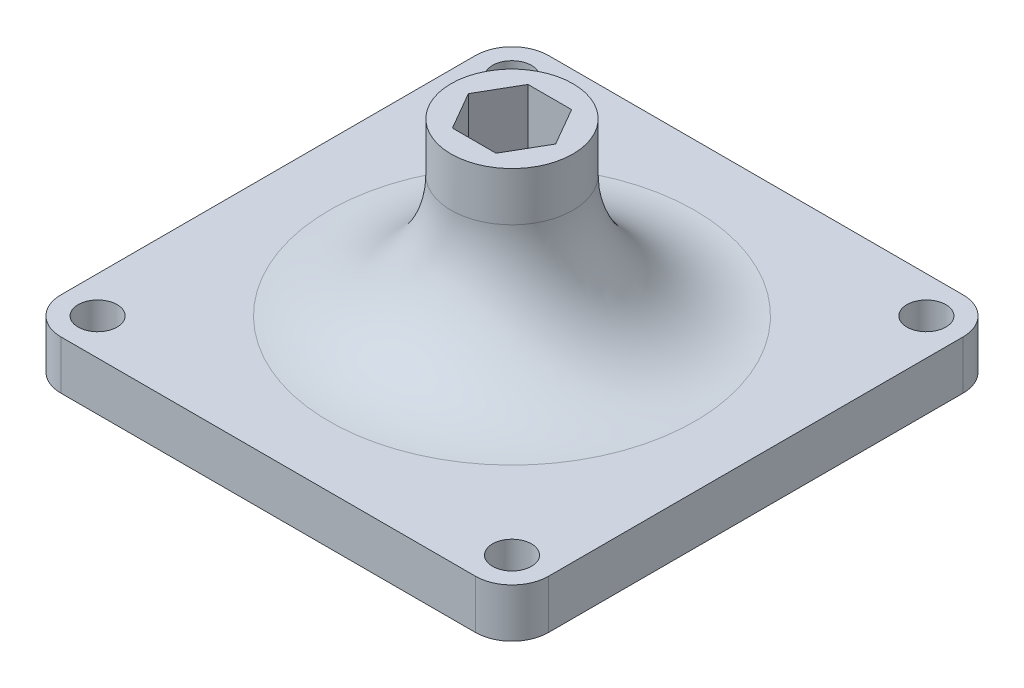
ISO-10303-21;
HEADER;
FILE_DESCRIPTION(('STEP AP214'),'2;1');
FILE_NAME('part.step','',(''),(''),'','','');
FILE_SCHEMA(('AUTOMOTIVE_DESIGN { 1 0 10303 214 1 1 1 1 }'));
ENDSEC;
DATA;
#1=APPLICATION_CONTEXT('core data for automotive mechanical design processes');
#2=APPLICATION_PROTOCOL_DEFINITION('international standard','automotive_design',2000,#1);
#3=PRODUCT_CONTEXT('',#1,'mechanical');
#4=PRODUCT('Part','Part','',(#3));
#5=PRODUCT_RELATED_PRODUCT_CATEGORY('part','',(#4));
#6=PRODUCT_DEFINITION_FORMATION('','',#4);
#7=PRODUCT_DEFINITION_CONTEXT('part definition',#1,'design');
#8=PRODUCT_DEFINITION('design','',#6,#7);
#9=PRODUCT_DEFINITION_SHAPE('','',#8);
#10=(LENGTH_UNIT() NAMED_UNIT(*) SI_UNIT(.MILLI.,.METRE.));
#11=(NAMED_UNIT(*) PLANE_ANGLE_UNIT() SI_UNIT($,.RADIAN.));
#12=(NAMED_UNIT(*) SI_UNIT($,.STERADIAN.) SOLID_ANGLE_UNIT());
#13=UNCERTAINTY_MEASURE_WITH_UNIT(LENGTH_MEASURE(1.E-05),#10,'distance_accuracy_value','');
#14=(GEOMETRIC_REPRESENTATION_CONTEXT(3) GLOBAL_UNCERTAINTY_ASSIGNED_CONTEXT((#13)) GLOBAL_UNIT_ASSIGNED_CONTEXT((#10,
#11,#12)) REPRESENTATION_CONTEXT('',''));
#15=CARTESIAN_POINT('',(0.,0.,0.));
#16=DIRECTION('',(0.,0.,1.));
#17=DIRECTION('',(1.,0.,0.));
#18=AXIS2_PLACEMENT_3D('',#15,#16,#17);
#19=CARTESIAN_POINT('',(17.0000000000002,4.,-17.));
#20=DIRECTION('',(0.,-1.,0.));
#21=DIRECTION('',(0.,0.,-1.));
#22=AXIS2_PLACEMENT_3D('',#19,#20,#21);
#23=PLANE('',#22);
#24=CARTESIAN_POINT('',(0.,4.,0.));
#25=DIRECTION('',(0.,-1.,0.));
#26=DIRECTION('',(0.,0.,-1.));
#27=AXIS2_PLACEMENT_3D('',#24,#25,#26);
#28=CIRCLE('',#27,15.);
#29=CARTESIAN_POINT('',(0.,4.,-15.));
#30=VERTEX_POINT('',#29);
#31=EDGE_CURVE('E11',#30,#30,#28,.T.);
#32=ORIENTED_EDGE('',*,*,#31,.T.);
#33=EDGE_LOOP('',(#32));
#34=FACE_BOUND('',#33,.T.);
#35=CARTESIAN_POINT('',(17.0000000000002,4.,-17.));
#36=DIRECTION('',(0.,1.,0.));
#37=DIRECTION('',(0.,0.,-1.));
#38=AXIS2_PLACEMENT_3D('',#35,#36,#37);
#39=CIRCLE('',#38,3.);
#40=CARTESIAN_POINT('',(20.0000000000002,4.,-17.));
#41=VERTEX_POINT('',#40);
#42=CARTESIAN_POINT('',(17.0000000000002,4.,-20.));
#43=VERTEX_POINT('',#42);
#44=EDGE_CURVE('E168',#41,#43,#39,.T.);
#45=ORIENTED_EDGE('',*,*,#44,.T.);
#46=DIRECTION('',(-1.,0.,0.));
#47=VECTOR('',#46,1.);
#48=CARTESIAN_POINT('',(-16.9999999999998,4.,-20.));
#49=LINE('',#48,#47);
#50=CARTESIAN_POINT('',(-16.9999999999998,4.,-20.));
#51=VERTEX_POINT('',#50);
#52=EDGE_CURVE('E108',#43,#51,#49,.T.);
#53=ORIENTED_EDGE('',*,*,#52,.T.);
#54=CARTESIAN_POINT('',(-16.9999999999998,4.,-17.));
#55=DIRECTION('',(0.,1.,0.));
#56=DIRECTION('',(0.,0.,1.));
#57=AXIS2_PLACEMENT_3D('',#54,#55,#56);
#58=CIRCLE('',#57,3.);
#59=CARTESIAN_POINT('',(-19.9999999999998,4.,-17.));
#60=VERTEX_POINT('',#59);
#61=EDGE_CURVE('E252',#51,#60,#58,.T.);
#62=ORIENTED_EDGE('',*,*,#61,.T.);
#63=DIRECTION('',(0.,0.,1.));
#64=VECTOR('',#63,1.);
#65=CARTESIAN_POINT('',(-19.9999999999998,4.,-17.));
#66=LINE('',#65,#64);
#67=CARTESIAN_POINT('',(-19.9999999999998,4.,17.));
#68=VERTEX_POINT('',#67);
#69=EDGE_CURVE('E254',#60,#68,#66,.T.);
#70=ORIENTED_EDGE('',*,*,#69,.T.);
#71=CARTESIAN_POINT('',(-16.9999999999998,4.,17.));
#72=DIRECTION('',(0.,1.,0.));
#73=DIRECTION('',(0.,0.,1.));
#74=AXIS2_PLACEMENT_3D('',#71,#72,#73);
#75=CIRCLE('',#74,3.);
#76=CARTESIAN_POINT('',(-16.9999999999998,4.,20.));
#77=VERTEX_POINT('',#76);
#78=EDGE_CURVE('E131',#68,#77,#75,.T.);
#79=ORIENTED_EDGE('',*,*,#78,.T.);
#80=DIRECTION('',(1.,0.,0.));
#81=VECTOR('',#80,1.);
#82=CARTESIAN_POINT('',(-16.9999999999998,4.,20.));
#83=LINE('',#82,#81);
#84=CARTESIAN_POINT('',(17.0000000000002,4.,20.));
#85=VERTEX_POINT('',#84);
#86=EDGE_CURVE('E124',#77,#85,#83,.T.);
#87=ORIENTED_EDGE('',*,*,#86,.T.);
#88=CARTESIAN_POINT('',(17.0000000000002,4.,17.));
#89=DIRECTION('',(0.,1.,0.));
#90=DIRECTION('',(0.,0.,1.));
#91=AXIS2_PLACEMENT_3D('',#88,#89,#90);
#92=CIRCLE('',#91,3.);
#93=CARTESIAN_POINT('',(20.0000000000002,4.,17.));
#94=VERTEX_POINT('',#93);
#95=EDGE_CURVE('E128',#85,#94,#92,.T.);
#96=ORIENTED_EDGE('',*,*,#95,.T.);
#97=DIRECTION('',(0.,0.,-1.));
#98=VECTOR('',#97,1.);
#99=CARTESIAN_POINT('',(20.0000000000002,4.,-17.));
#100=LINE('',#99,#98);
#101=EDGE_CURVE('E66',#94,#41,#100,.T.);
#102=ORIENTED_EDGE('',*,*,#101,.T.);
#103=EDGE_LOOP('',(#45,#53,#62,#70,#79,#87,#96,#102));
#104=FACE_BOUND('',#103,.T.);
#105=CARTESIAN_POINT('',(-17.0000000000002,4.,-17.));
#106=DIRECTION('',(0.,1.,0.));
#107=DIRECTION('',(0.,0.,1.));
#108=AXIS2_PLACEMENT_3D('',#105,#106,#107);
#109=CIRCLE('',#108,1.6);
#110=CARTESIAN_POINT('',(-17.0000000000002,4.,-15.4));
#111=VERTEX_POINT('',#110);
#112=EDGE_CURVE('E156',#111,#111,#109,.T.);
#113=ORIENTED_EDGE('',*,*,#112,.F.);
#114=EDGE_LOOP('',(#113));
#115=FACE_BOUND('',#114,.T.);
#116=CARTESIAN_POINT('',(16.9999999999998,4.,-17.));
#117=DIRECTION('',(0.,1.,0.));
#118=DIRECTION('',(0.,0.,1.));
#119=AXIS2_PLACEMENT_3D('',#116,#117,#118);
#120=CIRCLE('',#119,1.60000000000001);
#121=CARTESIAN_POINT('',(16.9999999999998,4.,-15.4));
#122=VERTEX_POINT('',#121);
#123=EDGE_CURVE('E263',#122,#122,#120,.T.);
#124=ORIENTED_EDGE('',*,*,#123,.F.);
#125=EDGE_LOOP('',(#124));
#126=FACE_BOUND('',#125,.T.);
#127=CARTESIAN_POINT('',(17.0000000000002,4.,17.));
#128=DIRECTION('',(0.,1.,0.));
#129=DIRECTION('',(0.,0.,1.));
#130=AXIS2_PLACEMENT_3D('',#127,#128,#129);
#131=CIRCLE('',#130,1.6);
#132=CARTESIAN_POINT('',(17.0000000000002,4.,18.6));
#133=VERTEX_POINT('',#132);
#134=EDGE_CURVE('E269',#133,#133,#131,.T.);
#135=ORIENTED_EDGE('',*,*,#134,.F.);
#136=EDGE_LOOP('',(#135));
#137=FACE_BOUND('',#136,.T.);
#138=CARTESIAN_POINT('',(-16.9999999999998,4.,17.));
#139=DIRECTION('',(0.,1.,0.));
#140=DIRECTION('',(0.,0.,1.));
#141=AXIS2_PLACEMENT_3D('',#138,#139,#140);
#142=CIRCLE('',#141,1.6);
#143=CARTESIAN_POINT('',(-16.9999999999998,4.,18.6));
#144=VERTEX_POINT('',#143);
#145=EDGE_CURVE('E275',#144,#144,#142,.T.);
#146=ORIENTED_EDGE('',*,*,#145,.F.);
#147=EDGE_LOOP('',(#146));
#148=FACE_BOUND('',#147,.T.);
#149=ADVANCED_FACE('F41',(#34,#104,#115,#126,#137,#148),#23,.F.);
#150=CARTESIAN_POINT('',(17.0000000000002,0.,-17.));
#151=DIRECTION('',(0.,-1.,0.));
#152=DIRECTION('',(0.,0.,-1.));
#153=AXIS2_PLACEMENT_3D('',#150,#151,#152);
#154=PLANE('',#153);
#155=CARTESIAN_POINT('',(0.,0.,0.));
#156=DIRECTION('',(0.,-1.,0.));
#157=DIRECTION('',(0.,0.,-1.));
#158=AXIS2_PLACEMENT_3D('',#155,#156,#157);
#159=CIRCLE('',#158,3.75);
#160=CARTESIAN_POINT('',(0.,0.,-3.75));
#161=VERTEX_POINT('',#160);
#162=EDGE_CURVE('E337',#161,#161,#159,.T.);
#163=ORIENTED_EDGE('',*,*,#162,.F.);
#164=EDGE_LOOP('',(#163));
#165=FACE_BOUND('',#164,.T.);
#166=CARTESIAN_POINT('',(17.0000000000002,0.,17.));
#167=DIRECTION('',(0.,1.,0.));
#168=DIRECTION('',(0.,0.,1.));
#169=AXIS2_PLACEMENT_3D('',#166,#167,#168);
#170=CIRCLE('',#169,1.6);
#171=CARTESIAN_POINT('',(17.0000000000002,0.,18.6));
#172=VERTEX_POINT('',#171);
#173=EDGE_CURVE('E272',#172,#172,#170,.T.);
#174=ORIENTED_EDGE('',*,*,#173,.T.);
#175=EDGE_LOOP('',(#174));
#176=FACE_BOUND('',#175,.T.);
#177=CARTESIAN_POINT('',(-17.0000000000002,0.,-17.));
#178=DIRECTION('',(0.,1.,0.));
#179=DIRECTION('',(0.,0.,1.));
#180=AXIS2_PLACEMENT_3D('',#177,#178,#179);
#181=CIRCLE('',#180,1.6);
#182=CARTESIAN_POINT('',(-17.0000000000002,0.,-15.4));
#183=VERTEX_POINT('',#182);
#184=EDGE_CURVE('E260',#183,#183,#181,.T.);
#185=ORIENTED_EDGE('',*,*,#184,.T.);
#186=EDGE_LOOP('',(#185));
#187=FACE_BOUND('',#186,.T.);
#188=CARTESIAN_POINT('',(17.0000000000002,0.,-17.));
#189=DIRECTION('',(0.,1.,0.));
#190=DIRECTION('',(0.,0.,-1.));
#191=AXIS2_PLACEMENT_3D('',#188,#189,#190);
#192=CIRCLE('',#191,3.);
#193=CARTESIAN_POINT('',(20.0000000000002,0.,-17.));
#194=VERTEX_POINT('',#193);
#195=CARTESIAN_POINT('',(17.0000000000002,0.,-20.));
#196=VERTEX_POINT('',#195);
#197=EDGE_CURVE('E152',#194,#196,#192,.T.);
#198=ORIENTED_EDGE('',*,*,#197,.F.);
#199=DIRECTION('',(0.,0.,-1.));
#200=VECTOR('',#199,1.);
#201=CARTESIAN_POINT('',(20.0000000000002,0.,-17.));
#202=LINE('',#201,#200);
#203=CARTESIAN_POINT('',(20.0000000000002,0.,17.));
#204=VERTEX_POINT('',#203);
#205=EDGE_CURVE('E99',#204,#194,#202,.T.);
#206=ORIENTED_EDGE('',*,*,#205,.F.);
#207=CARTESIAN_POINT('',(17.0000000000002,0.,17.));
#208=DIRECTION('',(0.,1.,0.));
#209=DIRECTION('',(0.,0.,1.));
#210=AXIS2_PLACEMENT_3D('',#207,#208,#209);
#211=CIRCLE('',#210,3.);
#212=CARTESIAN_POINT('',(17.0000000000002,0.,20.));
#213=VERTEX_POINT('',#212);
#214=EDGE_CURVE('E165',#213,#204,#211,.T.);
#215=ORIENTED_EDGE('',*,*,#214,.F.);
#216=DIRECTION('',(1.,0.,0.));
#217=VECTOR('',#216,1.);
#218=CARTESIAN_POINT('',(-16.9999999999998,0.,20.));
#219=LINE('',#218,#217);
#220=CARTESIAN_POINT('',(-16.9999999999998,0.,20.));
#221=VERTEX_POINT('',#220);
#222=EDGE_CURVE('E140',#221,#213,#219,.T.);
#223=ORIENTED_EDGE('',*,*,#222,.F.);
#224=CARTESIAN_POINT('',(-16.9999999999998,0.,17.));
#225=DIRECTION('',(0.,1.,0.));
#226=DIRECTION('',(0.,0.,1.));
#227=AXIS2_PLACEMENT_3D('',#224,#225,#226);
#228=CIRCLE('',#227,3.);
#229=CARTESIAN_POINT('',(-19.9999999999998,0.,17.));
#230=VERTEX_POINT('',#229);
#231=EDGE_CURVE('E162',#230,#221,#228,.T.);
#232=ORIENTED_EDGE('',*,*,#231,.F.);
#233=DIRECTION('',(0.,0.,1.));
#234=VECTOR('',#233,1.);
#235=CARTESIAN_POINT('',(-19.9999999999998,0.,-17.));
#236=LINE('',#235,#234);
#237=CARTESIAN_POINT('',(-19.9999999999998,0.,-17.));
#238=VERTEX_POINT('',#237);
#239=EDGE_CURVE('E160',#238,#230,#236,.T.);
#240=ORIENTED_EDGE('',*,*,#239,.F.);
#241=CARTESIAN_POINT('',(-16.9999999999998,0.,-17.));
#242=DIRECTION('',(0.,1.,0.));
#243=DIRECTION('',(0.,0.,1.));
#244=AXIS2_PLACEMENT_3D('',#241,#242,#243);
#245=CIRCLE('',#244,3.);
#246=CARTESIAN_POINT('',(-16.9999999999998,0.,-20.));
#247=VERTEX_POINT('',#246);
#248=EDGE_CURVE('E158',#247,#238,#245,.T.);
#249=ORIENTED_EDGE('',*,*,#248,.F.);
#250=DIRECTION('',(-1.,0.,0.));
#251=VECTOR('',#250,1.);
#252=CARTESIAN_POINT('',(-16.9999999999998,0.,-20.));
#253=LINE('',#252,#251);
#254=EDGE_CURVE('E155',#196,#247,#253,.T.);
#255=ORIENTED_EDGE('',*,*,#254,.F.);
#256=EDGE_LOOP('',(#198,#206,#215,#223,#232,#240,#249,#255));
#257=FACE_BOUND('',#256,.T.);
#258=CARTESIAN_POINT('',(16.9999999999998,0.,-17.));
#259=DIRECTION('',(0.,1.,0.));
#260=DIRECTION('',(0.,0.,1.));
#261=AXIS2_PLACEMENT_3D('',#258,#259,#260);
#262=CIRCLE('',#261,1.60000000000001);
#263=CARTESIAN_POINT('',(16.9999999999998,0.,-15.4));
#264=VERTEX_POINT('',#263);
#265=EDGE_CURVE('E266',#264,#264,#262,.T.);
#266=ORIENTED_EDGE('',*,*,#265,.T.);
#267=EDGE_LOOP('',(#266));
#268=FACE_BOUND('',#267,.T.);
#269=CARTESIAN_POINT('',(-16.9999999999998,0.,17.));
#270=DIRECTION('',(0.,1.,0.));
#271=DIRECTION('',(0.,0.,1.));
#272=AXIS2_PLACEMENT_3D('',#269,#270,#271);
#273=CIRCLE('',#272,1.6);
#274=CARTESIAN_POINT('',(-16.9999999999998,0.,18.6));
#275=VERTEX_POINT('',#274);
#276=EDGE_CURVE('E278',#275,#275,#273,.T.);
#277=ORIENTED_EDGE('',*,*,#276,.T.);
#278=EDGE_LOOP('',(#277));
#279=FACE_BOUND('',#278,.T.);
#280=ADVANCED_FACE('F204',(#165,#176,#187,#257,#268,#279),#154,.T.);
#281=CARTESIAN_POINT('',(17.0000000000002,4.,-17.));
#282=DIRECTION('',(0.,-1.,0.));
#283=DIRECTION('',(0.,0.,-1.));
#284=AXIS2_PLACEMENT_3D('',#281,#282,#283);
#285=CYLINDRICAL_SURFACE('',#284,3.);
#286=ORIENTED_EDGE('',*,*,#197,.T.);
#287=DIRECTION('',(0.,-1.,0.));
#288=VECTOR('',#287,1.);
#289=CARTESIAN_POINT('',(17.0000000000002,4.,-20.));
#290=LINE('',#289,#288);
#291=EDGE_CURVE('E181',#43,#196,#290,.T.);
#292=ORIENTED_EDGE('',*,*,#291,.F.);
#293=ORIENTED_EDGE('',*,*,#44,.F.);
#294=DIRECTION('',(0.,-1.,0.));
#295=VECTOR('',#294,1.);
#296=CARTESIAN_POINT('',(20.0000000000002,4.,-17.));
#297=LINE('',#296,#295);
#298=EDGE_CURVE('E148',#41,#194,#297,.T.);
#299=ORIENTED_EDGE('',*,*,#298,.T.);
#300=EDGE_LOOP('',(#286,#292,#293,#299));
#301=FACE_BOUND('',#300,.T.);
#302=ADVANCED_FACE('F211',(#301),#285,.T.);
#303=CARTESIAN_POINT('',(-16.9999999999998,4.,-20.));
#304=DIRECTION('',(0.,0.,1.));
#305=DIRECTION('',(1.,0.,0.));
#306=AXIS2_PLACEMENT_3D('',#303,#304,#305);
#307=PLANE('',#306);
#308=ORIENTED_EDGE('',*,*,#254,.T.);
#309=DIRECTION('',(0.,-1.,0.));
#310=VECTOR('',#309,1.);
#311=CARTESIAN_POINT('',(-16.9999999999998,4.,-20.));
#312=LINE('',#311,#310);
#313=EDGE_CURVE('E178',#51,#247,#312,.T.);
#314=ORIENTED_EDGE('',*,*,#313,.F.);
#315=ORIENTED_EDGE('',*,*,#52,.F.);
#316=ORIENTED_EDGE('',*,*,#291,.T.);
#317=EDGE_LOOP('',(#308,#314,#315,#316));
#318=FACE_BOUND('',#317,.T.);
#319=ADVANCED_FACE('F236',(#318),#307,.F.);
#320=CARTESIAN_POINT('',(-16.9999999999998,4.,-17.));
#321=DIRECTION('',(0.,-1.,0.));
#322=DIRECTION('',(0.,0.,-1.));
#323=AXIS2_PLACEMENT_3D('',#320,#321,#322);
#324=CYLINDRICAL_SURFACE('',#323,3.);
#325=ORIENTED_EDGE('',*,*,#248,.T.);
#326=DIRECTION('',(0.,-1.,0.));
#327=VECTOR('',#326,1.);
#328=CARTESIAN_POINT('',(-19.9999999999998,4.,-17.));
#329=LINE('',#328,#327);
#330=EDGE_CURVE('E175',#60,#238,#329,.T.);
#331=ORIENTED_EDGE('',*,*,#330,.F.);
#332=ORIENTED_EDGE('',*,*,#61,.F.);
#333=ORIENTED_EDGE('',*,*,#313,.T.);
#334=EDGE_LOOP('',(#325,#331,#332,#333));
#335=FACE_BOUND('',#334,.T.);
#336=ADVANCED_FACE('F232',(#335),#324,.T.);
#337=CARTESIAN_POINT('',(-19.9999999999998,4.,-17.));
#338=DIRECTION('',(1.,0.,0.));
#339=DIRECTION('',(0.,0.,-1.));
#340=AXIS2_PLACEMENT_3D('',#337,#338,#339);
#341=PLANE('',#340);
#342=ORIENTED_EDGE('',*,*,#239,.T.);
#343=DIRECTION('',(0.,-1.,0.));
#344=VECTOR('',#343,1.);
#345=CARTESIAN_POINT('',(-19.9999999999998,4.,17.));
#346=LINE('',#345,#344);
#347=EDGE_CURVE('E172',#68,#230,#346,.T.);
#348=ORIENTED_EDGE('',*,*,#347,.F.);
#349=ORIENTED_EDGE('',*,*,#69,.F.);
#350=ORIENTED_EDGE('',*,*,#330,.T.);
#351=EDGE_LOOP('',(#342,#348,#349,#350));
#352=FACE_BOUND('',#351,.T.);
#353=ADVANCED_FACE('F228',(#352),#341,.F.);
#354=CARTESIAN_POINT('',(-16.9999999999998,4.,17.));
#355=DIRECTION('',(0.,-1.,0.));
#356=DIRECTION('',(0.,0.,-1.));
#357=AXIS2_PLACEMENT_3D('',#354,#355,#356);
#358=CYLINDRICAL_SURFACE('',#357,3.);
#359=ORIENTED_EDGE('',*,*,#231,.T.);
#360=DIRECTION('',(0.,-1.,0.));
#361=VECTOR('',#360,1.);
#362=CARTESIAN_POINT('',(-16.9999999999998,4.,20.));
#363=LINE('',#362,#361);
#364=EDGE_CURVE('E143',#77,#221,#363,.T.);
#365=ORIENTED_EDGE('',*,*,#364,.F.);
#366=ORIENTED_EDGE('',*,*,#78,.F.);
#367=ORIENTED_EDGE('',*,*,#347,.T.);
#368=EDGE_LOOP('',(#359,#365,#366,#367));
#369=FACE_BOUND('',#368,.T.);
#370=ADVANCED_FACE('F225',(#369),#358,.T.);
#371=CARTESIAN_POINT('',(-16.9999999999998,4.,20.));
#372=DIRECTION('',(0.,0.,-1.));
#373=DIRECTION('',(-1.,0.,0.));
#374=AXIS2_PLACEMENT_3D('',#371,#372,#373);
#375=PLANE('',#374);
#376=ORIENTED_EDGE('',*,*,#222,.T.);
#377=DIRECTION('',(0.,-1.,0.));
#378=VECTOR('',#377,1.);
#379=CARTESIAN_POINT('',(17.0000000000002,4.,20.));
#380=LINE('',#379,#378);
#381=EDGE_CURVE('E137',#85,#213,#380,.T.);
#382=ORIENTED_EDGE('',*,*,#381,.F.);
#383=ORIENTED_EDGE('',*,*,#86,.F.);
#384=ORIENTED_EDGE('',*,*,#364,.T.);
#385=EDGE_LOOP('',(#376,#382,#383,#384));
#386=FACE_BOUND('',#385,.T.);
#387=ADVANCED_FACE('F138',(#386),#375,.F.);
#388=CARTESIAN_POINT('',(17.0000000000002,4.,17.));
#389=DIRECTION('',(0.,-1.,0.));
#390=DIRECTION('',(0.,0.,-1.));
#391=AXIS2_PLACEMENT_3D('',#388,#389,#390);
#392=CYLINDRICAL_SURFACE('',#391,3.);
#393=ORIENTED_EDGE('',*,*,#214,.T.);
#394=DIRECTION('',(0.,-1.,0.));
#395=VECTOR('',#394,1.);
#396=CARTESIAN_POINT('',(20.0000000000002,4.,17.));
#397=LINE('',#396,#395);
#398=EDGE_CURVE('E144',#94,#204,#397,.T.);
#399=ORIENTED_EDGE('',*,*,#398,.F.);
#400=ORIENTED_EDGE('',*,*,#95,.F.);
#401=ORIENTED_EDGE('',*,*,#381,.T.);
#402=EDGE_LOOP('',(#393,#399,#400,#401));
#403=FACE_BOUND('',#402,.T.);
#404=ADVANCED_FACE('F146',(#403),#392,.T.);
#405=CARTESIAN_POINT('',(20.0000000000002,4.,-17.));
#406=DIRECTION('',(-1.,0.,0.));
#407=DIRECTION('',(0.,0.,1.));
#408=AXIS2_PLACEMENT_3D('',#405,#406,#407);
#409=PLANE('',#408);
#410=ORIENTED_EDGE('',*,*,#205,.T.);
#411=ORIENTED_EDGE('',*,*,#298,.F.);
#412=ORIENTED_EDGE('',*,*,#101,.F.);
#413=ORIENTED_EDGE('',*,*,#398,.T.);
#414=EDGE_LOOP('',(#410,#411,#412,#413));
#415=FACE_BOUND('',#414,.T.);
#416=ADVANCED_FACE('F218',(#415),#409,.F.);
#417=CARTESIAN_POINT('',(-17.0000000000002,4.,-17.));
#418=DIRECTION('',(0.,-1.,0.));
#419=DIRECTION('',(0.,0.,-1.));
#420=AXIS2_PLACEMENT_3D('',#417,#418,#419);
#421=CYLINDRICAL_SURFACE('',#420,1.6);
#422=ORIENTED_EDGE('',*,*,#112,.T.);
#423=EDGE_LOOP('',(#422));
#424=FACE_BOUND('',#423,.T.);
#425=ORIENTED_EDGE('',*,*,#184,.F.);
#426=EDGE_LOOP('',(#425));
#427=FACE_BOUND('',#426,.T.);
#428=ADVANCED_FACE('F215',(#424,#427),#421,.F.);
#429=CARTESIAN_POINT('',(16.9999999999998,4.,-17.));
#430=DIRECTION('',(0.,-1.,0.));
#431=DIRECTION('',(0.,0.,-1.));
#432=AXIS2_PLACEMENT_3D('',#429,#430,#431);
#433=CYLINDRICAL_SURFACE('',#432,1.60000000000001);
#434=ORIENTED_EDGE('',*,*,#123,.T.);
#435=EDGE_LOOP('',(#434));
#436=FACE_BOUND('',#435,.T.);
#437=ORIENTED_EDGE('',*,*,#265,.F.);
#438=EDGE_LOOP('',(#437));
#439=FACE_BOUND('',#438,.T.);
#440=ADVANCED_FACE('F418',(#436,#439),#433,.F.);
#441=CARTESIAN_POINT('',(17.0000000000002,4.,17.));
#442=DIRECTION('',(0.,-1.,0.));
#443=DIRECTION('',(0.,0.,-1.));
#444=AXIS2_PLACEMENT_3D('',#441,#442,#443);
#445=CYLINDRICAL_SURFACE('',#444,1.6);
#446=ORIENTED_EDGE('',*,*,#134,.T.);
#447=EDGE_LOOP('',(#446));
#448=FACE_BOUND('',#447,.T.);
#449=ORIENTED_EDGE('',*,*,#173,.F.);
#450=EDGE_LOOP('',(#449));
#451=FACE_BOUND('',#450,.T.);
#452=ADVANCED_FACE('F415',(#448,#451),#445,.F.);
#453=CARTESIAN_POINT('',(-16.9999999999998,4.,17.));
#454=DIRECTION('',(0.,-1.,0.));
#455=DIRECTION('',(0.,0.,-1.));
#456=AXIS2_PLACEMENT_3D('',#453,#454,#455);
#457=CYLINDRICAL_SURFACE('',#456,1.6);
#458=ORIENTED_EDGE('',*,*,#145,.T.);
#459=EDGE_LOOP('',(#458));
#460=FACE_BOUND('',#459,.T.);
#461=ORIENTED_EDGE('',*,*,#276,.F.);
#462=EDGE_LOOP('',(#461));
#463=FACE_BOUND('',#462,.T.);
#464=ADVANCED_FACE('F413',(#460,#463),#457,.F.);
#465=CARTESIAN_POINT('',(0.,18.,0.));
#466=DIRECTION('',(0.,-1.,0.));
#467=DIRECTION('',(0.,0.,-1.));
#468=AXIS2_PLACEMENT_3D('',#465,#466,#467);
#469=CYLINDRICAL_SURFACE('',#468,5.);
#470=CARTESIAN_POINT('',(0.,14.,0.));
#471=DIRECTION('',(0.,-1.,0.));
#472=DIRECTION('',(0.,0.,-1.));
#473=AXIS2_PLACEMENT_3D('',#470,#471,#472);
#474=CIRCLE('',#473,5.);
#475=CARTESIAN_POINT('',(0.,14.,-5.));
#476=VERTEX_POINT('',#475);
#477=EDGE_CURVE('E50',#476,#476,#474,.F.);
#478=ORIENTED_EDGE('',*,*,#477,.T.);
#479=EDGE_LOOP('',(#478));
#480=FACE_BOUND('',#479,.T.);
#481=CARTESIAN_POINT('',(0.,18.,0.));
#482=DIRECTION('',(0.,1.,0.));
#483=DIRECTION('',(0.,0.,1.));
#484=AXIS2_PLACEMENT_3D('',#481,#482,#483);
#485=CIRCLE('',#484,5.);
#486=CARTESIAN_POINT('',(0.,18.,5.));
#487=VERTEX_POINT('',#486);
#488=EDGE_CURVE('E281',#487,#487,#485,.T.);
#489=ORIENTED_EDGE('',*,*,#488,.F.);
#490=EDGE_LOOP('',(#489));
#491=FACE_BOUND('',#490,.T.);
#492=ADVANCED_FACE('F186',(#480,#491),#469,.T.);
#493=CARTESIAN_POINT('',(0.,18.,0.));
#494=DIRECTION('',(0.,1.,0.));
#495=DIRECTION('',(0.,0.,1.));
#496=AXIS2_PLACEMENT_3D('',#493,#494,#495);
#497=PLANE('',#496);
#498=DIRECTION('',(0.5,0.,-0.866025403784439));
#499=VECTOR('',#498,1.);
#500=CARTESIAN_POINT('',(1.78978583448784,18.,3.1));
#501=LINE('',#500,#499);
#502=CARTESIAN_POINT('',(1.78978583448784,18.,3.1));
#503=VERTEX_POINT('',#502);
#504=CARTESIAN_POINT('',(3.57957166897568,18.,0.));
#505=VERTEX_POINT('',#504);
#506=EDGE_CURVE('E57',#503,#505,#501,.T.);
#507=ORIENTED_EDGE('',*,*,#506,.F.);
#508=DIRECTION('',(1.,0.,0.));
#509=VECTOR('',#508,1.);
#510=CARTESIAN_POINT('',(-1.78978583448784,18.,3.1));
#511=LINE('',#510,#509);
#512=CARTESIAN_POINT('',(-1.78978583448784,18.,3.1));
#513=VERTEX_POINT('',#512);
#514=EDGE_CURVE('E303',#513,#503,#511,.T.);
#515=ORIENTED_EDGE('',*,*,#514,.F.);
#516=DIRECTION('',(0.5,0.,0.866025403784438));
#517=VECTOR('',#516,1.);
#518=CARTESIAN_POINT('',(-3.57957166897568,18.,0.));
#519=LINE('',#518,#517);
#520=CARTESIAN_POINT('',(-3.57957166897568,18.,0.));
#521=VERTEX_POINT('',#520);
#522=EDGE_CURVE('E307',#521,#513,#519,.T.);
#523=ORIENTED_EDGE('',*,*,#522,.F.);
#524=DIRECTION('',(-0.5,0.,0.866025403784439));
#525=VECTOR('',#524,1.);
#526=CARTESIAN_POINT('',(-1.78978583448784,18.,-3.1));
#527=LINE('',#526,#525);
#528=CARTESIAN_POINT('',(-1.78978583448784,18.,-3.1));
#529=VERTEX_POINT('',#528);
#530=EDGE_CURVE('E310',#529,#521,#527,.T.);
#531=ORIENTED_EDGE('',*,*,#530,.F.);
#532=DIRECTION('',(-1.,0.,0.));
#533=VECTOR('',#532,1.);
#534=CARTESIAN_POINT('',(1.78978583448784,18.,-3.1));
#535=LINE('',#534,#533);
#536=CARTESIAN_POINT('',(1.78978583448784,18.,-3.1));
#537=VERTEX_POINT('',#536);
#538=EDGE_CURVE('E313',#537,#529,#535,.T.);
#539=ORIENTED_EDGE('',*,*,#538,.F.);
#540=DIRECTION('',(-0.5,0.,-0.866025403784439));
#541=VECTOR('',#540,1.);
#542=CARTESIAN_POINT('',(3.57957166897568,18.,0.));
#543=LINE('',#542,#541);
#544=EDGE_CURVE('E316',#505,#537,#543,.T.);
#545=ORIENTED_EDGE('',*,*,#544,.F.);
#546=EDGE_LOOP('',(#507,#515,#523,#531,#539,#545));
#547=FACE_BOUND('',#546,.T.);
#548=ORIENTED_EDGE('',*,*,#488,.T.);
#549=EDGE_LOOP('',(#548));
#550=FACE_BOUND('',#549,.T.);
#551=ADVANCED_FACE('F191',(#547,#550),#497,.T.);
#552=CARTESIAN_POINT('',(0.,14.,0.));
#553=DIRECTION('',(0.,-1.,0.));
#554=DIRECTION('',(0.,0.,-1.));
#555=AXIS2_PLACEMENT_3D('',#552,#553,#554);
#556=TOROIDAL_SURFACE('',#555,15.,10.);
#557=ORIENTED_EDGE('',*,*,#31,.F.);
#558=EDGE_LOOP('',(#557));
#559=FACE_BOUND('',#558,.T.);
#560=ORIENTED_EDGE('',*,*,#477,.F.);
#561=EDGE_LOOP('',(#560));
#562=FACE_BOUND('',#561,.T.);
#563=ADVANCED_FACE('F43',(#559,#562),#556,.F.);
#564=CARTESIAN_POINT('',(1.78978583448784,10.,3.1));
#565=DIRECTION('',(0.866025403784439,0.,0.5));
#566=DIRECTION('',(0.5,0.,-0.866025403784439));
#567=AXIS2_PLACEMENT_3D('',#564,#565,#566);
#568=PLANE('',#567);
#569=ORIENTED_EDGE('',*,*,#506,.T.);
#570=DIRECTION('',(0.,1.,0.));
#571=VECTOR('',#570,1.);
#572=CARTESIAN_POINT('',(3.57957166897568,10.,0.));
#573=LINE('',#572,#571);
#574=CARTESIAN_POINT('',(3.57957166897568,10.,0.));
#575=VERTEX_POINT('',#574);
#576=EDGE_CURVE('E287',#575,#505,#573,.T.);
#577=ORIENTED_EDGE('',*,*,#576,.F.);
#578=DIRECTION('',(0.5,0.,-0.866025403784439));
#579=VECTOR('',#578,1.);
#580=CARTESIAN_POINT('',(1.78978583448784,10.,3.1));
#581=LINE('',#580,#579);
#582=CARTESIAN_POINT('',(1.78978583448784,10.,3.1));
#583=VERTEX_POINT('',#582);
#584=EDGE_CURVE('E306',#583,#575,#581,.T.);
#585=ORIENTED_EDGE('',*,*,#584,.F.);
#586=DIRECTION('',(0.,1.,0.));
#587=VECTOR('',#586,1.);
#588=CARTESIAN_POINT('',(1.78978583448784,10.,3.1));
#589=LINE('',#588,#587);
#590=EDGE_CURVE('E286',#583,#503,#589,.T.);
#591=ORIENTED_EDGE('',*,*,#590,.T.);
#592=EDGE_LOOP('',(#569,#577,#585,#591));
#593=FACE_BOUND('',#592,.T.);
#594=ADVANCED_FACE('F190',(#593),#568,.F.);
#595=CARTESIAN_POINT('',(-1.78978583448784,10.,3.1));
#596=DIRECTION('',(0.,0.,1.));
#597=DIRECTION('',(1.,0.,0.));
#598=AXIS2_PLACEMENT_3D('',#595,#596,#597);
#599=PLANE('',#598);
#600=ORIENTED_EDGE('',*,*,#514,.T.);
#601=ORIENTED_EDGE('',*,*,#590,.F.);
#602=DIRECTION('',(1.,0.,0.));
#603=VECTOR('',#602,1.);
#604=CARTESIAN_POINT('',(-1.78978583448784,10.,3.1));
#605=LINE('',#604,#603);
#606=CARTESIAN_POINT('',(-1.78978583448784,10.,3.1));
#607=VERTEX_POINT('',#606);
#608=EDGE_CURVE('E290',#607,#583,#605,.T.);
#609=ORIENTED_EDGE('',*,*,#608,.F.);
#610=DIRECTION('',(0.,1.,0.));
#611=VECTOR('',#610,1.);
#612=CARTESIAN_POINT('',(-1.78978583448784,10.,3.1));
#613=LINE('',#612,#611);
#614=EDGE_CURVE('E299',#607,#513,#613,.T.);
#615=ORIENTED_EDGE('',*,*,#614,.T.);
#616=EDGE_LOOP('',(#600,#601,#609,#615));
#617=FACE_BOUND('',#616,.T.);
#618=ADVANCED_FACE('F198',(#617),#599,.F.);
#619=CARTESIAN_POINT('',(-3.57957166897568,10.,0.));
#620=DIRECTION('',(-0.866025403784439,0.,0.5));
#621=DIRECTION('',(0.5,0.,0.866025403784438));
#622=AXIS2_PLACEMENT_3D('',#619,#620,#621);
#623=PLANE('',#622);
#624=ORIENTED_EDGE('',*,*,#522,.T.);
#625=ORIENTED_EDGE('',*,*,#614,.F.);
#626=DIRECTION('',(0.5,0.,0.866025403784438));
#627=VECTOR('',#626,1.);
#628=CARTESIAN_POINT('',(-3.57957166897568,10.,0.));
#629=LINE('',#628,#627);
#630=CARTESIAN_POINT('',(-3.57957166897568,10.,0.));
#631=VERTEX_POINT('',#630);
#632=EDGE_CURVE('E323',#631,#607,#629,.T.);
#633=ORIENTED_EDGE('',*,*,#632,.F.);
#634=DIRECTION('',(0.,1.,0.));
#635=VECTOR('',#634,1.);
#636=CARTESIAN_POINT('',(-3.57957166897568,10.,0.));
#637=LINE('',#636,#635);
#638=EDGE_CURVE('E296',#631,#521,#637,.T.);
#639=ORIENTED_EDGE('',*,*,#638,.T.);
#640=EDGE_LOOP('',(#624,#625,#633,#639));
#641=FACE_BOUND('',#640,.T.);
#642=ADVANCED_FACE('F382',(#641),#623,.F.);
#643=CARTESIAN_POINT('',(-1.78978583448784,10.,-3.1));
#644=DIRECTION('',(-0.866025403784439,0.,-0.5));
#645=DIRECTION('',(-0.5,0.,0.866025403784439));
#646=AXIS2_PLACEMENT_3D('',#643,#644,#645);
#647=PLANE('',#646);
#648=ORIENTED_EDGE('',*,*,#530,.T.);
#649=ORIENTED_EDGE('',*,*,#638,.F.);
#650=DIRECTION('',(-0.5,0.,0.866025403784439));
#651=VECTOR('',#650,1.);
#652=CARTESIAN_POINT('',(-1.78978583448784,10.,-3.1));
#653=LINE('',#652,#651);
#654=CARTESIAN_POINT('',(-1.78978583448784,10.,-3.1));
#655=VERTEX_POINT('',#654);
#656=EDGE_CURVE('E326',#655,#631,#653,.T.);
#657=ORIENTED_EDGE('',*,*,#656,.F.);
#658=DIRECTION('',(0.,1.,0.));
#659=VECTOR('',#658,1.);
#660=CARTESIAN_POINT('',(-1.78978583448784,10.,-3.1));
#661=LINE('',#660,#659);
#662=EDGE_CURVE('E293',#655,#529,#661,.T.);
#663=ORIENTED_EDGE('',*,*,#662,.T.);
#664=EDGE_LOOP('',(#648,#649,#657,#663));
#665=FACE_BOUND('',#664,.T.);
#666=ADVANCED_FACE('F399',(#665),#647,.F.);
#667=CARTESIAN_POINT('',(1.78978583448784,10.,-3.1));
#668=DIRECTION('',(0.,0.,-1.));
#669=DIRECTION('',(-1.,0.,0.));
#670=AXIS2_PLACEMENT_3D('',#667,#668,#669);
#671=PLANE('',#670);
#672=ORIENTED_EDGE('',*,*,#538,.T.);
#673=ORIENTED_EDGE('',*,*,#662,.F.);
#674=DIRECTION('',(-1.,0.,0.));
#675=VECTOR('',#674,1.);
#676=CARTESIAN_POINT('',(1.78978583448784,10.,-3.1));
#677=LINE('',#676,#675);
#678=CARTESIAN_POINT('',(1.78978583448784,10.,-3.1));
#679=VERTEX_POINT('',#678);
#680=EDGE_CURVE('E329',#679,#655,#677,.T.);
#681=ORIENTED_EDGE('',*,*,#680,.F.);
#682=DIRECTION('',(0.,1.,0.));
#683=VECTOR('',#682,1.);
#684=CARTESIAN_POINT('',(1.78978583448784,10.,-3.1));
#685=LINE('',#684,#683);
#686=EDGE_CURVE('E289',#679,#537,#685,.T.);
#687=ORIENTED_EDGE('',*,*,#686,.T.);
#688=EDGE_LOOP('',(#672,#673,#681,#687));
#689=FACE_BOUND('',#688,.T.);
#690=ADVANCED_FACE('F395',(#689),#671,.F.);
#691=CARTESIAN_POINT('',(3.57957166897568,10.,0.));
#692=DIRECTION('',(0.866025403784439,0.,-0.5));
#693=DIRECTION('',(-0.5,0.,-0.866025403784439));
#694=AXIS2_PLACEMENT_3D('',#691,#692,#693);
#695=PLANE('',#694);
#696=ORIENTED_EDGE('',*,*,#544,.T.);
#697=ORIENTED_EDGE('',*,*,#686,.F.);
#698=DIRECTION('',(-0.5,0.,-0.866025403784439));
#699=VECTOR('',#698,1.);
#700=CARTESIAN_POINT('',(3.57957166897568,10.,0.));
#701=LINE('',#700,#699);
#702=EDGE_CURVE('E332',#575,#679,#701,.T.);
#703=ORIENTED_EDGE('',*,*,#702,.F.);
#704=ORIENTED_EDGE('',*,*,#576,.T.);
#705=EDGE_LOOP('',(#696,#697,#703,#704));
#706=FACE_BOUND('',#705,.T.);
#707=ADVANCED_FACE('F355',(#706),#695,.F.);
#708=CARTESIAN_POINT('',(0.,10.,0.));
#709=DIRECTION('',(0.,1.,0.));
#710=DIRECTION('',(0.,0.,1.));
#711=AXIS2_PLACEMENT_3D('',#708,#709,#710);
#712=PLANE('',#711);
#713=CARTESIAN_POINT('',(0.,10.,0.));
#714=DIRECTION('',(0.,1.,0.));
#715=DIRECTION('',(0.,0.,1.));
#716=AXIS2_PLACEMENT_3D('',#713,#714,#715);
#717=CIRCLE('',#716,2.1);
#718=CARTESIAN_POINT('',(0.,10.,2.1));
#719=VERTEX_POINT('',#718);
#720=EDGE_CURVE('E45',#719,#719,#717,.T.);
#721=ORIENTED_EDGE('',*,*,#720,.F.);
#722=EDGE_LOOP('',(#721));
#723=FACE_BOUND('',#722,.T.);
#724=ORIENTED_EDGE('',*,*,#584,.T.);
#725=ORIENTED_EDGE('',*,*,#702,.T.);
#726=ORIENTED_EDGE('',*,*,#680,.T.);
#727=ORIENTED_EDGE('',*,*,#656,.T.);
#728=ORIENTED_EDGE('',*,*,#632,.T.);
#729=ORIENTED_EDGE('',*,*,#608,.T.);
#730=EDGE_LOOP('',(#724,#725,#726,#727,#728,#729));
#731=FACE_BOUND('',#730,.T.);
#732=ADVANCED_FACE('F351',(#723,#731),#712,.T.);
#733=CARTESIAN_POINT('',(0.,5.,0.));
#734=DIRECTION('',(0.,-1.,0.));
#735=DIRECTION('',(0.,0.,-1.));
#736=AXIS2_PLACEMENT_3D('',#733,#734,#735);
#737=CYLINDRICAL_SURFACE('',#736,3.75);
#738=CARTESIAN_POINT('',(0.,5.,0.));
#739=DIRECTION('',(0.,-1.,0.));
#740=DIRECTION('',(0.,0.,-1.));
#741=AXIS2_PLACEMENT_3D('',#738,#739,#740);
#742=CIRCLE('',#741,3.75);
#743=CARTESIAN_POINT('',(0.,5.,-3.75));
#744=VERTEX_POINT('',#743);
#745=EDGE_CURVE('E320',#744,#744,#742,.T.);
#746=ORIENTED_EDGE('',*,*,#745,.F.);
#747=EDGE_LOOP('',(#746));
#748=FACE_BOUND('',#747,.T.);
#749=ORIENTED_EDGE('',*,*,#162,.T.);
#750=EDGE_LOOP('',(#749));
#751=FACE_BOUND('',#750,.T.);
#752=ADVANCED_FACE('F354',(#748,#751),#737,.F.);
#753=CARTESIAN_POINT('',(0.,5.,0.));
#754=DIRECTION('',(0.,-1.,0.));
#755=DIRECTION('',(0.,0.,-1.));
#756=AXIS2_PLACEMENT_3D('',#753,#754,#755);
#757=PLANE('',#756);
#758=CARTESIAN_POINT('',(0.,5.,0.));
#759=DIRECTION('',(0.,-1.,0.));
#760=DIRECTION('',(0.,0.,-1.));
#761=AXIS2_PLACEMENT_3D('',#758,#759,#760);
#762=CIRCLE('',#761,2.1);
#763=CARTESIAN_POINT('',(0.,5.,-2.1));
#764=VERTEX_POINT('',#763);
#765=EDGE_CURVE('E342',#764,#764,#762,.T.);
#766=ORIENTED_EDGE('',*,*,#765,.F.);
#767=EDGE_LOOP('',(#766));
#768=FACE_BOUND('',#767,.T.);
#769=ORIENTED_EDGE('',*,*,#745,.T.);
#770=EDGE_LOOP('',(#769));
#771=FACE_BOUND('',#770,.T.);
#772=ADVANCED_FACE('F504',(#768,#771),#757,.T.);
#773=CARTESIAN_POINT('',(0.,18.,0.));
#774=DIRECTION('',(0.,-1.,0.));
#775=DIRECTION('',(0.,0.,-1.));
#776=AXIS2_PLACEMENT_3D('',#773,#774,#775);
#777=CYLINDRICAL_SURFACE('',#776,2.1);
#778=ORIENTED_EDGE('',*,*,#720,.T.);
#779=EDGE_LOOP('',(#778));
#780=FACE_BOUND('',#779,.T.);
#781=ORIENTED_EDGE('',*,*,#765,.T.);
#782=EDGE_LOOP('',(#781));
#783=FACE_BOUND('',#782,.T.);
#784=ADVANCED_FACE('F349',(#780,#783),#777,.F.);
#785=CLOSED_SHELL('',(#149,#280,#302,#319,#336,#353,#370,#387,#404,#416,#428,#440,#452,#464,
#492,#551,#563,#594,#618,#642,#666,#690,#707,#732,#752,#772,#784));
#786=MANIFOLD_SOLID_BREP('B2',#785);
#787=ADVANCED_BREP_SHAPE_REPRESENTATION('',(#18,#786),#14);
#788=SHAPE_DEFINITION_REPRESENTATION(#9,#787);
ENDSEC;
END-ISO-10303-21;
